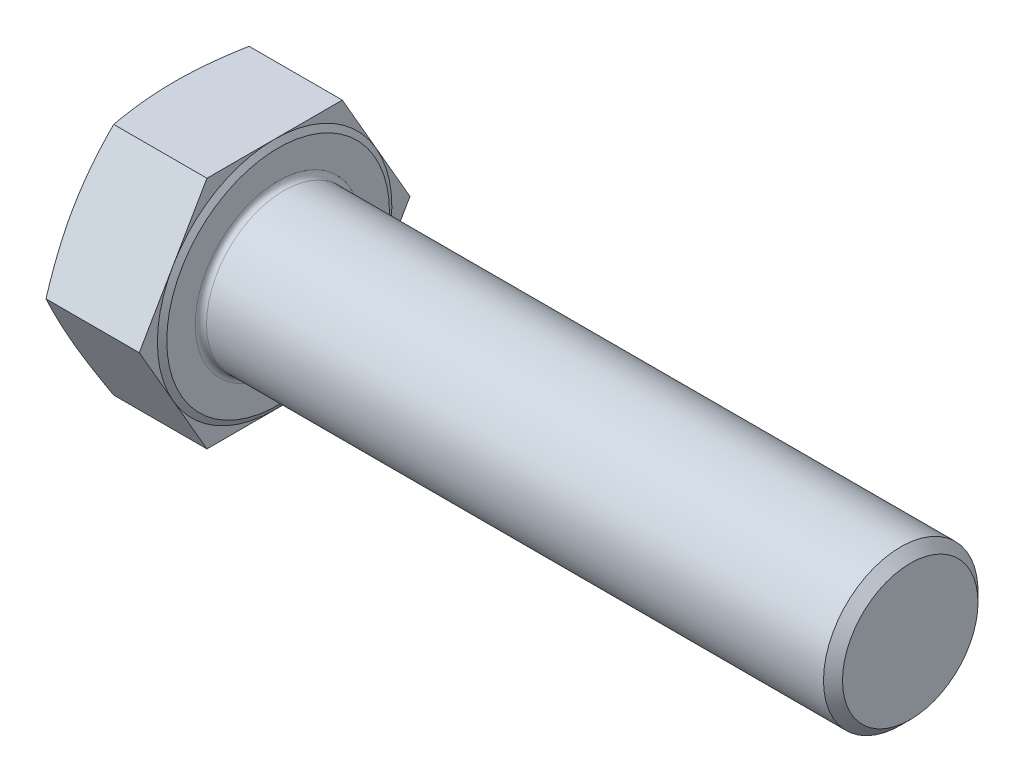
from build123d import *

# Parameters (mm, degrees)
BASEHEAD_DEPTH = 14.22
SKETCH3_R      = 11
BASEBODY_DEPTH = 90
HEADFILLET_R   = 0.8
CHAMFER1_SIZE  = 1.353


with BuildPart() as part:
    # Sketch-BaseHead → BaseHead (new body)
    with BuildSketch(Plane(origin=(0, 0, 0), x_dir=(0, 0, -1), z_dir=(1, 0, 0))):
        Polygon((19.271951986, 0), (9.635975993, 16.69), (-9.635975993, 16.69), (-19.271951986, 0), (-9.635975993, -16.69), (9.635975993, -16.69), align=None)
    extrude(amount=BASEHEAD_DEPTH)

    # Sketch4 → HeadChamfer (revolve, cut)
    with BuildSketch(Plane(origin=(-0.264637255, 0, 5.916896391), x_dir=(0, 0, -1), z_dir=(0, 1, 0))):
        Polygon((25.188848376, -0.264637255), (22.606896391, -0.264637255), (25.188848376, -1.204390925), align=None)
    revolve(axis=Axis((-4.001564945, 0, 0), (1, 0, 0)), mode=Mode.SUBTRACT)

    # Sketch1 → Revolve1 (revolve)
    with BuildSketch(Plane.XY, mode=Mode.PRIVATE) as revolve1_sk:
        Polygon((14.22, 0), (14.72, 0), (14.72, -15.855), (14.22, -16.69), align=None)
    revolve(revolve1_sk.sketch.rotate(Axis((-4.001564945, 0, 0), (1, 0, 0)), 270), axis=Axis((-4.001564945, 0, 0), (1, 0, 0)))

    # Sketch3 → BaseBody (add)
    with BuildSketch(Plane(origin=(14.72, 0, 0), x_dir=(0, 0, -1), z_dir=(1, 0, 0))):
        with Locations(Location((0, 0, 0), (0, 0, 180))):
            Circle(SKETCH3_R)
    extrude(amount=BASEBODY_DEPTH)

    # HeadFillet
    headfillet_edges = [part.edges().sort_by_distance(p)[0] for p in [
        (14.72, 0, -11),
    ]]
    fillet(headfillet_edges, radius=HEADFILLET_R)

    # Chamfer1
    chamfer1_edges = [part.edges().sort_by_distance(p)[0] for p in [
        (104.72, 0, -11),
    ]]
    chamfer(chamfer1_edges, length=CHAMFER1_SIZE)


solid = part.part
